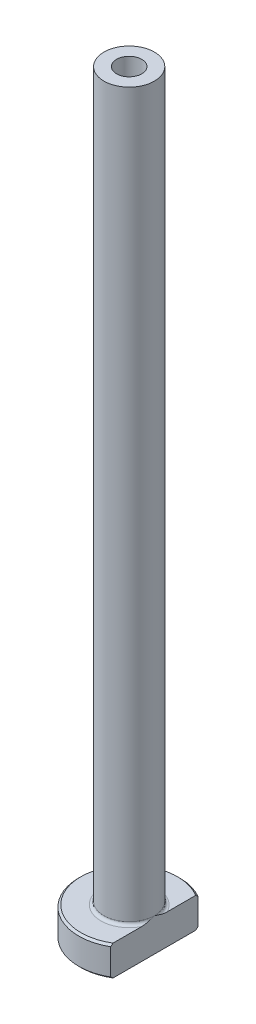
from build123d import *

# Parameters (mm, degrees)
FILLET1_R          = 0.3
CHAMFER1_SIZE      = 0.2
CUT_EXTRUDE1_DEPTH = 76.332595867
CHAMFER2_SIZE      = 0.5


with BuildPart() as part:
    # Sketch1 → Revolve1 (revolve)
    with BuildSketch(Plane.XY, mode=Mode.PRIVATE) as revolve1_sk:
        Polygon((-1.25, 75), (-2.5, 75), (-2.5, 3), (-5, 3), (-5, 0), (-1.5, 0), (-1.5, 28), (-1.25, 40), align=None)
    revolve(revolve1_sk.sketch.rotate(Axis((0, 92.187680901, 0), (0, -1, 0)), 270), axis=Axis((0, 92.187680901, 0), (0, -1, 0)))

    # Fillet1
    fillet1_edges = [part.edges().sort_by_distance(p)[0] for p in [
        (0, 3, -2.5),
    ]]
    fillet(fillet1_edges, radius=FILLET1_R)

    # Chamfer1
    chamfer1_edges = [part.edges().sort_by_distance(p)[0] for p in [
        (0, 0, -5),
        (0, 3, -5),
    ]]
    chamfer(chamfer1_edges, length=CHAMFER1_SIZE)

    # Sketch2 → Cut-Extrude1 (cut, through all)
    with BuildSketch(Plane.XZ):
        with BuildLine():
            Line((2.5, 4.330127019), (2.5, -4.330127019))
            ThreePointArc((2.5, -4.330127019), (5, 0), (2.5, 4.330127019))
        make_face()
    extrude(amount=-CUT_EXTRUDE1_DEPTH, mode=Mode.SUBTRACT)

    # Chamfer2
    chamfer2_edges = [part.edges().sort_by_distance(p)[0] for p in [
        (0, 0, -1.5),
    ]]
    chamfer(chamfer2_edges, length=CHAMFER2_SIZE)


solid = part.part
